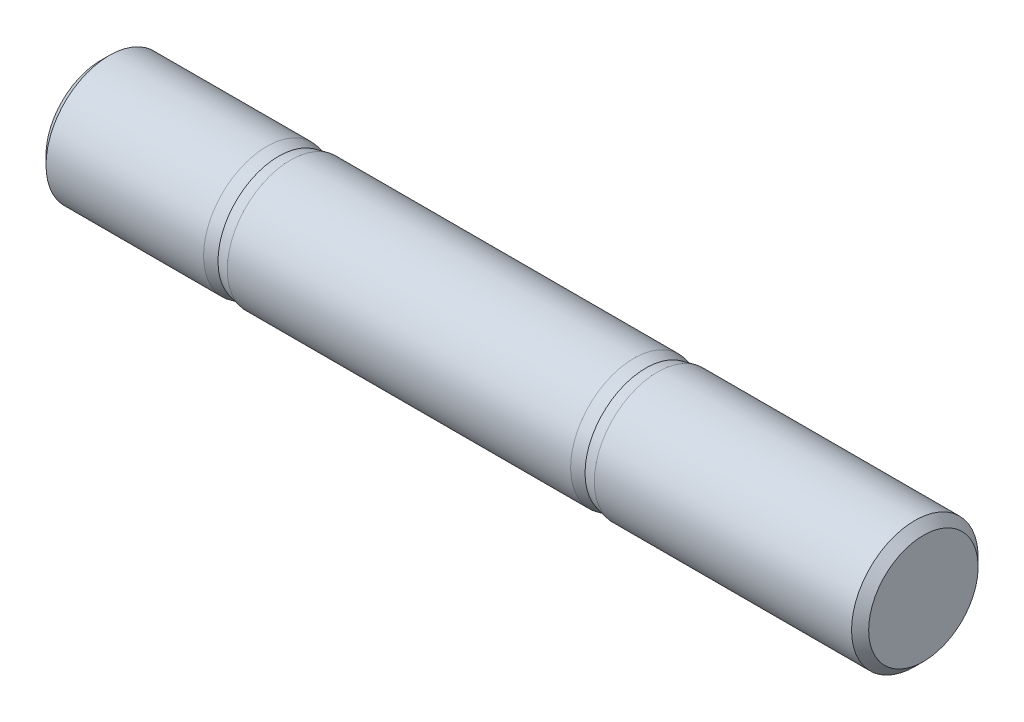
from build123d import *

# Parameters (mm, degrees)
HEADCHAMFER_SIZE = 1.353


with BuildPart() as part:
    # Sketch1 → BaseHead (revolve)
    with BuildSketch(Plane.XY, mode=Mode.PRIVATE) as basehead_sk:
        Polygon((0, 0), (0, 10), (26.25, 10), (30, 9.188), (84.25, 9.188), (88, 10), (130, 10), (130, 0), align=None)
    revolve(basehead_sk.sketch.rotate(Axis((-1.310841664, 0, 0), (1, 0, 0)), 90), axis=Axis((-1.310841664, 0, 0), (1, 0, 0)))

    # HeadChamfer
    headchamfer_edges = [part.edges().sort_by_distance(p)[0] for p in [
        (130, 0, -10),
        (0, 0, -10),
    ]]
    chamfer(headchamfer_edges, length=HEADCHAMFER_SIZE)

    # Sketch2 → BaseBody (revolve)
    with BuildSketch(Plane.XY, mode=Mode.PRIVATE) as basebody_sk:
        Polygon((26.25, 9.188), (30, 10), (84.25, 10), (88, 9.188), align=None)
    revolve(basebody_sk.sketch.rotate(Axis((-1.310841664, 0, 0), (1, 0, 0)), 90), axis=Axis((-1.310841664, 0, 0), (1, 0, 0)))


solid = part.part
